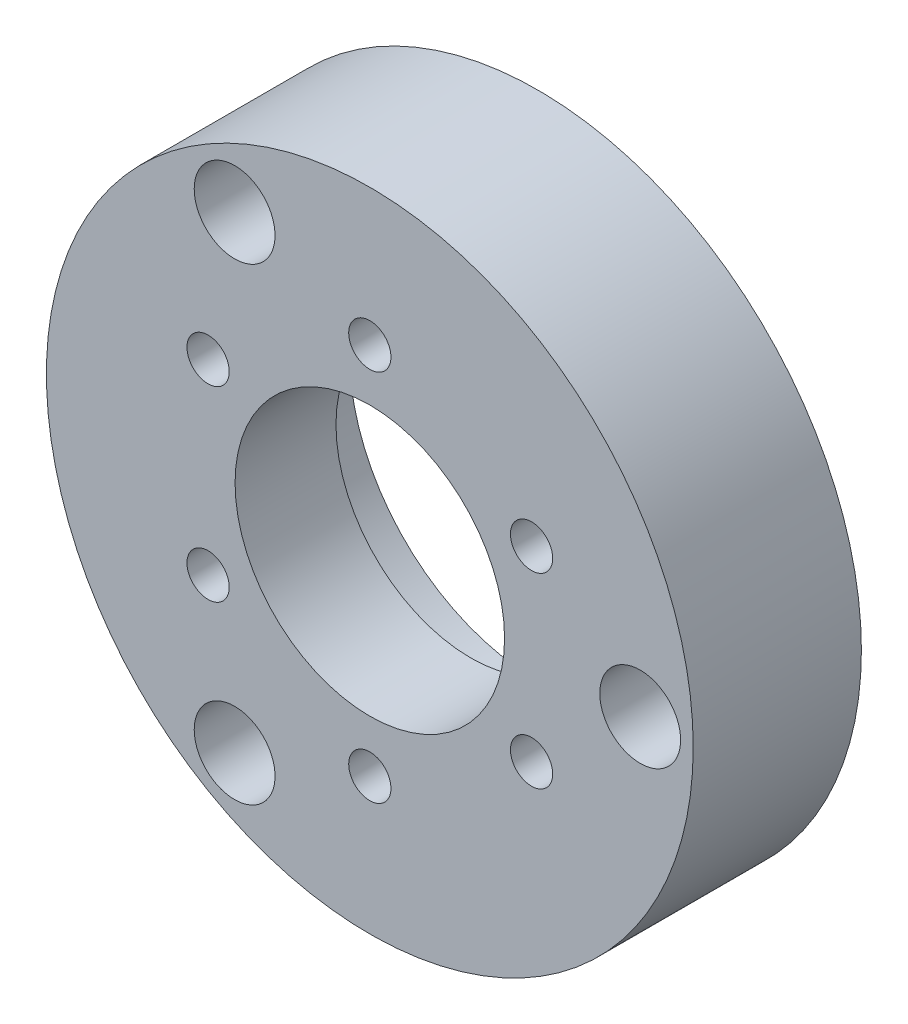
from build123d import *

# Parameters (mm, degrees)
CUT_EXTRUDE1_START = 6.35
SKETCH2_R          = 2.4892
CUT_EXTRUDE1_DEPTH = 25.4
CIRPATTERN1_COUNT  = 6
SKETCH4_R          = 3.175
CUT_EXTRUDE2_DEPTH = 50.8
CUT_EXTRUDE3_START = 6.35
SKETCH5_R          = 4.7625
CUT_EXTRUDE3_DEPTH = 50.8


with BuildPart() as part:
    # Sketch1 → Revolve1 (revolve)
    with BuildSketch(Plane(origin=(0, 0, 0), x_dir=(0, 0, -1), z_dir=(1, 0, 0)), mode=Mode.PRIVATE) as revolve1_sk:
        Polygon((0, 22.1996), (-7.9248, 22.1996), (-7.9248, 15.875), (-19.812, 15.875), (-19.812, 38.1), (0, 38.1), align=None)
    revolve(revolve1_sk.sketch.rotate(Axis((0, 0, 0), (0, 0, -1)), 90), axis=Axis((0, 0, 0), (0, 0, -1)))

    # Sketch2 → Cut-Extrude1 (cut)
    with BuildSketch(Plane.XY.offset(CUT_EXTRUDE1_START)):
        with Locations(Location((0, 22, 0), (0, 0, 180))):
            Circle(SKETCH2_R)
    cut_extrude1 = extrude(amount=CUT_EXTRUDE1_DEPTH, mode=Mode.SUBTRACT)

    # CirPattern1: Cut-Extrude1 ×6 about axis
    cirpattern1_axis = Axis((0, 0, 0), (0, 0, 1))
    for i in range(1, CIRPATTERN1_COUNT):
        add(cut_extrude1.rotate(cirpattern1_axis, i * 360 / CIRPATTERN1_COUNT), mode=Mode.SUBTRACT)

    # Sketch4 → Cut-Extrude2 (cut)
    with BuildSketch(Plane.XY):
        with Locations(Location((-15.9258, -27.584294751, 0), (0, 0, 180))):
            Circle(SKETCH4_R)
        with Locations(Location((31.8516, 0, 0), (0, 0, 180))):
            Circle(SKETCH4_R)
        with Locations(Location((-15.9258, 27.584294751, 0), (0, 0, 180))):
            Circle(SKETCH4_R)
    extrude(amount=CUT_EXTRUDE2_DEPTH, mode=Mode.SUBTRACT)

    # Sketch5 → Cut-Extrude3 (cut)
    with BuildSketch(Plane.XY.offset(CUT_EXTRUDE3_START)):
        with Locations(Location((-15.9258, 27.584294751, 0), (0, 0, 180))):
            Circle(SKETCH5_R)
        with Locations(Location((-15.9258, -27.584294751, 0), (0, 0, 180))):
            Circle(SKETCH5_R)
        with Locations(Location((31.8516, 0, 0), (0, 0, 180))):
            Circle(SKETCH5_R)
    extrude(amount=CUT_EXTRUDE3_DEPTH, mode=Mode.SUBTRACT)


solid = part.part
